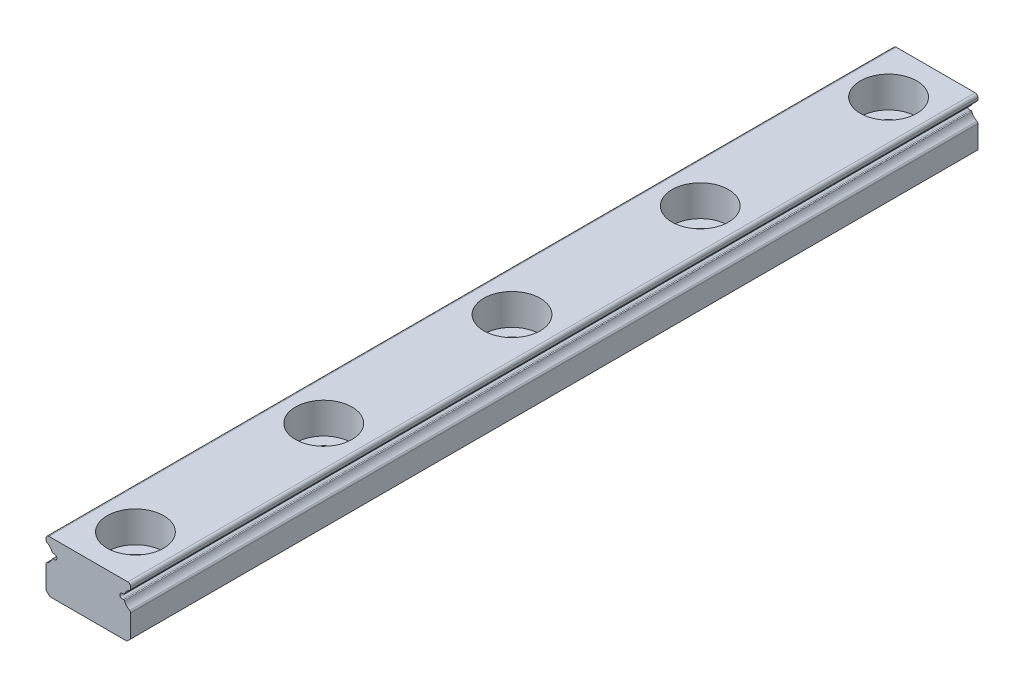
ISO-10303-21;
HEADER;
FILE_DESCRIPTION(('STEP AP214'),'2;1');
FILE_NAME('part.step','',(''),(''),'','','');
FILE_SCHEMA(('AUTOMOTIVE_DESIGN { 1 0 10303 214 1 1 1 1 }'));
ENDSEC;
DATA;
#1=APPLICATION_CONTEXT('core data for automotive mechanical design processes');
#2=APPLICATION_PROTOCOL_DEFINITION('international standard','automotive_design',2000,#1);
#3=PRODUCT_CONTEXT('',#1,'mechanical');
#4=PRODUCT('Part','Part','',(#3));
#5=PRODUCT_RELATED_PRODUCT_CATEGORY('part','',(#4));
#6=PRODUCT_DEFINITION_FORMATION('','',#4);
#7=PRODUCT_DEFINITION_CONTEXT('part definition',#1,'design');
#8=PRODUCT_DEFINITION('design','',#6,#7);
#9=PRODUCT_DEFINITION_SHAPE('','',#8);
#10=(LENGTH_UNIT() NAMED_UNIT(*) SI_UNIT(.MILLI.,.METRE.));
#11=(NAMED_UNIT(*) PLANE_ANGLE_UNIT() SI_UNIT($,.RADIAN.));
#12=(NAMED_UNIT(*) SI_UNIT($,.STERADIAN.) SOLID_ANGLE_UNIT());
#13=UNCERTAINTY_MEASURE_WITH_UNIT(LENGTH_MEASURE(1.E-05),#10,'distance_accuracy_value','');
#14=(GEOMETRIC_REPRESENTATION_CONTEXT(3) GLOBAL_UNCERTAINTY_ASSIGNED_CONTEXT((#13)) GLOBAL_UNIT_ASSIGNED_CONTEXT((#10,
#11,#12)) REPRESENTATION_CONTEXT('',''));
#15=CARTESIAN_POINT('',(0.,0.,0.));
#16=DIRECTION('',(0.,0.,1.));
#17=DIRECTION('',(1.,0.,0.));
#18=AXIS2_PLACEMENT_3D('',#15,#16,#17);
#19=CARTESIAN_POINT('',(-3.74687682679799,-5.85,-90.));
#20=DIRECTION('',(0.,-1.,0.));
#21=DIRECTION('',(0.,0.,-1.));
#22=AXIS2_PLACEMENT_3D('',#19,#20,#21);
#23=PLANE('',#22);
#24=DIRECTION('',(1.,0.,0.));
#25=VECTOR('',#24,1.);
#26=CARTESIAN_POINT('',(-3.74687682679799,-5.85,-90.));
#27=LINE('',#26,#25);
#28=CARTESIAN_POINT('',(-3.7468768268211,-5.85,-90.));
#29=VERTEX_POINT('',#28);
#30=CARTESIAN_POINT('',(-3.6,-5.85,-90.));
#31=VERTEX_POINT('',#30);
#32=EDGE_CURVE('E235',#29,#31,#27,.T.);
#33=ORIENTED_EDGE('',*,*,#32,.T.);
#34=DIRECTION('',(0.,0.,-1.));
#35=VECTOR('',#34,1.);
#36=CARTESIAN_POINT('',(-3.6,-5.85,-90.));
#37=LINE('',#36,#35);
#38=CARTESIAN_POINT('',(-3.6,-5.85,0.));
#39=VERTEX_POINT('',#38);
#40=EDGE_CURVE('E206',#31,#39,#37,.F.);
#41=ORIENTED_EDGE('',*,*,#40,.T.);
#42=DIRECTION('',(1.,0.,0.));
#43=VECTOR('',#42,1.);
#44=CARTESIAN_POINT('',(-3.74687682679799,-5.85,0.));
#45=LINE('',#44,#43);
#46=CARTESIAN_POINT('',(-3.7468768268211,-5.85,0.));
#47=VERTEX_POINT('',#46);
#48=EDGE_CURVE('E241',#39,#47,#45,.F.);
#49=ORIENTED_EDGE('',*,*,#48,.T.);
#50=DIRECTION('',(0.,0.,-1.));
#51=VECTOR('',#50,1.);
#52=CARTESIAN_POINT('',(-3.7468768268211,-5.85,-90.));
#53=LINE('',#52,#51);
#54=EDGE_CURVE('E232',#29,#47,#53,.F.);
#55=ORIENTED_EDGE('',*,*,#54,.F.);
#56=EDGE_LOOP('',(#33,#41,#49,#55));
#57=FACE_BOUND('',#56,.T.);
#58=ADVANCED_FACE('F16',(#57),#23,.T.);
#59=CARTESIAN_POINT('',(3.6,-5.85,-90.));
#60=DIRECTION('',(0.,-1.,0.));
#61=DIRECTION('',(0.,0.,-1.));
#62=AXIS2_PLACEMENT_3D('',#59,#60,#61);
#63=PLANE('',#62);
#64=DIRECTION('',(1.,0.,0.));
#65=VECTOR('',#64,1.);
#66=CARTESIAN_POINT('',(3.6,-5.85,-90.));
#67=LINE('',#66,#65);
#68=CARTESIAN_POINT('',(3.6,-5.85,-90.));
#69=VERTEX_POINT('',#68);
#70=CARTESIAN_POINT('',(3.74687682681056,-5.85,-90.));
#71=VERTEX_POINT('',#70);
#72=EDGE_CURVE('E208',#69,#71,#67,.T.);
#73=ORIENTED_EDGE('',*,*,#72,.T.);
#74=DIRECTION('',(0.,0.,-1.));
#75=VECTOR('',#74,1.);
#76=CARTESIAN_POINT('',(3.746876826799,-5.85,-90.));
#77=LINE('',#76,#75);
#78=CARTESIAN_POINT('',(3.74687682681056,-5.85,0.));
#79=VERTEX_POINT('',#78);
#80=EDGE_CURVE('E244',#79,#71,#77,.T.);
#81=ORIENTED_EDGE('',*,*,#80,.F.);
#82=DIRECTION('',(1.,0.,0.));
#83=VECTOR('',#82,1.);
#84=CARTESIAN_POINT('',(3.6,-5.85,0.));
#85=LINE('',#84,#83);
#86=CARTESIAN_POINT('',(3.6,-5.85,0.));
#87=VERTEX_POINT('',#86);
#88=EDGE_CURVE('E233',#79,#87,#85,.F.);
#89=ORIENTED_EDGE('',*,*,#88,.T.);
#90=DIRECTION('',(0.,0.,-1.));
#91=VECTOR('',#90,1.);
#92=CARTESIAN_POINT('',(3.6,-5.85,-90.));
#93=LINE('',#92,#91);
#94=EDGE_CURVE('E228',#87,#69,#93,.T.);
#95=ORIENTED_EDGE('',*,*,#94,.T.);
#96=EDGE_LOOP('',(#73,#81,#89,#95));
#97=FACE_BOUND('',#96,.T.);
#98=ADVANCED_FACE('F554',(#97),#63,.T.);
#99=CARTESIAN_POINT('',(-3.6,-6.1,-90.));
#100=DIRECTION('',(0.,0.,-1.));
#101=DIRECTION('',(-1.,0.,0.));
#102=AXIS2_PLACEMENT_3D('',#99,#100,#101);
#103=CYLINDRICAL_SURFACE('',#102,0.25);
#104=ORIENTED_EDGE('',*,*,#40,.F.);
#105=CARTESIAN_POINT('',(-3.6,-6.1,-90.));
#106=DIRECTION('',(0.,0.,-1.));
#107=DIRECTION('',(-1.,0.,0.));
#108=AXIS2_PLACEMENT_3D('',#105,#106,#107);
#109=CIRCLE('',#108,0.25);
#110=CARTESIAN_POINT('',(-3.6,-6.35,-90.));
#111=VERTEX_POINT('',#110);
#112=EDGE_CURVE('E19',#111,#31,#109,.F.);
#113=ORIENTED_EDGE('',*,*,#112,.F.);
#114=DIRECTION('',(0.,0.,1.));
#115=VECTOR('',#114,1.);
#116=CARTESIAN_POINT('',(-3.6,-6.35,-90.));
#117=LINE('',#116,#115);
#118=CARTESIAN_POINT('',(-3.6,-6.35,0.));
#119=VERTEX_POINT('',#118);
#120=EDGE_CURVE('E203',#119,#111,#117,.F.);
#121=ORIENTED_EDGE('',*,*,#120,.F.);
#122=CARTESIAN_POINT('',(-3.6,-6.1,0.));
#123=DIRECTION('',(0.,0.,-1.));
#124=DIRECTION('',(-1.,0.,0.));
#125=AXIS2_PLACEMENT_3D('',#122,#123,#124);
#126=CIRCLE('',#125,0.25);
#127=EDGE_CURVE('E249',#39,#119,#126,.T.);
#128=ORIENTED_EDGE('',*,*,#127,.F.);
#129=EDGE_LOOP('',(#104,#113,#121,#128));
#130=FACE_BOUND('',#129,.T.);
#131=ADVANCED_FACE('F200',(#130),#103,.F.);
#132=CARTESIAN_POINT('',(3.74687682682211,-5.75,-90.));
#133=DIRECTION('',(0.,0.,-1.));
#134=DIRECTION('',(-1.,0.,0.));
#135=AXIS2_PLACEMENT_3D('',#132,#133,#134);
#136=CYLINDRICAL_SURFACE('',#135,0.0999999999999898);
#137=CARTESIAN_POINT('',(3.74687682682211,-5.75,-90.));
#138=DIRECTION('',(0.,0.,-1.));
#139=DIRECTION('',(-1.,0.,0.));
#140=AXIS2_PLACEMENT_3D('',#137,#138,#139);
#141=CIRCLE('',#140,0.0999999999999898);
#142=CARTESIAN_POINT('',(3.84052964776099,-5.78505922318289,-90.));
#143=VERTEX_POINT('',#142);
#144=EDGE_CURVE('E247',#71,#143,#141,.F.);
#145=ORIENTED_EDGE('',*,*,#144,.T.);
#146=DIRECTION('',(0.,0.,-1.));
#147=VECTOR('',#146,1.);
#148=CARTESIAN_POINT('',(3.84052964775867,-5.78505922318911,-90.));
#149=LINE('',#148,#147);
#150=CARTESIAN_POINT('',(3.840529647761,-5.78505922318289,0.));
#151=VERTEX_POINT('',#150);
#152=EDGE_CURVE('E226',#143,#151,#149,.F.);
#153=ORIENTED_EDGE('',*,*,#152,.T.);
#154=CARTESIAN_POINT('',(3.74687682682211,-5.75,0.));
#155=DIRECTION('',(0.,0.,-1.));
#156=DIRECTION('',(-1.,0.,0.));
#157=AXIS2_PLACEMENT_3D('',#154,#155,#156);
#158=CIRCLE('',#157,0.0999999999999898);
#159=EDGE_CURVE('E248',#151,#79,#158,.T.);
#160=ORIENTED_EDGE('',*,*,#159,.T.);
#161=ORIENTED_EDGE('',*,*,#80,.T.);
#162=EDGE_LOOP('',(#145,#153,#160,#161));
#163=FACE_BOUND('',#162,.T.);
#164=ADVANCED_FACE('F557',(#163),#136,.T.);
#165=CARTESIAN_POINT('',(-3.7468768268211,-5.75,-90.));
#166=DIRECTION('',(0.,0.,-1.));
#167=DIRECTION('',(-1.,0.,0.));
#168=AXIS2_PLACEMENT_3D('',#165,#166,#167);
#169=CYLINDRICAL_SURFACE('',#168,0.0999999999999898);
#170=CARTESIAN_POINT('',(-3.7468768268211,-5.75,-90.));
#171=DIRECTION('',(0.,0.,-1.));
#172=DIRECTION('',(-1.,0.,0.));
#173=AXIS2_PLACEMENT_3D('',#170,#171,#172);
#174=CIRCLE('',#173,0.0999999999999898);
#175=CARTESIAN_POINT('',(-3.84052964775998,-5.78505922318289,-90.));
#176=VERTEX_POINT('',#175);
#177=EDGE_CURVE('E239',#176,#29,#174,.F.);
#178=ORIENTED_EDGE('',*,*,#177,.T.);
#179=ORIENTED_EDGE('',*,*,#54,.T.);
#180=CARTESIAN_POINT('',(-3.7468768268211,-5.75,0.));
#181=DIRECTION('',(0.,0.,-1.));
#182=DIRECTION('',(-1.,0.,0.));
#183=AXIS2_PLACEMENT_3D('',#180,#181,#182);
#184=CIRCLE('',#183,0.0999999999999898);
#185=CARTESIAN_POINT('',(-3.84052964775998,-5.78505922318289,0.));
#186=VERTEX_POINT('',#185);
#187=EDGE_CURVE('E391',#47,#186,#184,.T.);
#188=ORIENTED_EDGE('',*,*,#187,.T.);
#189=DIRECTION('',(0.,0.,-1.));
#190=VECTOR('',#189,1.);
#191=CARTESIAN_POINT('',(-3.84052964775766,-5.78505922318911,-90.));
#192=LINE('',#191,#190);
#193=EDGE_CURVE('E382',#186,#176,#192,.T.);
#194=ORIENTED_EDGE('',*,*,#193,.T.);
#195=EDGE_LOOP('',(#178,#179,#188,#194));
#196=FACE_BOUND('',#195,.T.);
#197=ADVANCED_FACE('F405',(#196),#169,.T.);
#198=CARTESIAN_POINT('',(3.6,-6.1,-90.));
#199=DIRECTION('',(0.,0.,-1.));
#200=DIRECTION('',(-1.,0.,0.));
#201=AXIS2_PLACEMENT_3D('',#198,#199,#200);
#202=CYLINDRICAL_SURFACE('',#201,0.25);
#203=DIRECTION('',(0.,0.,1.));
#204=VECTOR('',#203,1.);
#205=CARTESIAN_POINT('',(3.6,-6.35,-90.));
#206=LINE('',#205,#204);
#207=CARTESIAN_POINT('',(3.6,-6.35,-90.));
#208=VERTEX_POINT('',#207);
#209=CARTESIAN_POINT('',(3.6,-6.35,0.));
#210=VERTEX_POINT('',#209);
#211=EDGE_CURVE('E375',#208,#210,#206,.T.);
#212=ORIENTED_EDGE('',*,*,#211,.F.);
#213=CARTESIAN_POINT('',(3.6,-6.1,-90.));
#214=DIRECTION('',(0.,0.,-1.));
#215=DIRECTION('',(-1.,0.,0.));
#216=AXIS2_PLACEMENT_3D('',#213,#214,#215);
#217=CIRCLE('',#216,0.25);
#218=EDGE_CURVE('E231',#69,#208,#217,.F.);
#219=ORIENTED_EDGE('',*,*,#218,.F.);
#220=ORIENTED_EDGE('',*,*,#94,.F.);
#221=CARTESIAN_POINT('',(3.6,-6.1,0.));
#222=DIRECTION('',(0.,0.,-1.));
#223=DIRECTION('',(-1.,0.,0.));
#224=AXIS2_PLACEMENT_3D('',#221,#222,#223);
#225=CIRCLE('',#224,0.25);
#226=EDGE_CURVE('E222',#210,#87,#225,.T.);
#227=ORIENTED_EDGE('',*,*,#226,.F.);
#228=EDGE_LOOP('',(#212,#219,#220,#227));
#229=FACE_BOUND('',#228,.T.);
#230=ADVANCED_FACE('F543',(#229),#202,.F.);
#231=CARTESIAN_POINT('',(-3.6,-6.35,-90.));
#232=DIRECTION('',(0.,1.,0.));
#233=DIRECTION('',(0.,0.,1.));
#234=AXIS2_PLACEMENT_3D('',#231,#232,#233);
#235=PLANE('',#234);
#236=DIRECTION('',(1.,0.,0.));
#237=VECTOR('',#236,1.);
#238=CARTESIAN_POINT('',(-3.6,-6.35,-90.));
#239=LINE('',#238,#237);
#240=CARTESIAN_POINT('',(-3.74687682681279,-6.35,-90.));
#241=VERTEX_POINT('',#240);
#242=EDGE_CURVE('E210',#111,#241,#239,.F.);
#243=ORIENTED_EDGE('',*,*,#242,.T.);
#244=DIRECTION('',(0.,0.,-1.));
#245=VECTOR('',#244,1.);
#246=CARTESIAN_POINT('',(-3.74687682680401,-6.35,-90.));
#247=LINE('',#246,#245);
#248=CARTESIAN_POINT('',(-3.74687682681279,-6.35,0.));
#249=VERTEX_POINT('',#248);
#250=EDGE_CURVE('E371',#249,#241,#247,.T.);
#251=ORIENTED_EDGE('',*,*,#250,.F.);
#252=DIRECTION('',(1.,0.,0.));
#253=VECTOR('',#252,1.);
#254=CARTESIAN_POINT('',(-3.6,-6.35,0.));
#255=LINE('',#254,#253);
#256=EDGE_CURVE('E220',#249,#119,#255,.T.);
#257=ORIENTED_EDGE('',*,*,#256,.T.);
#258=ORIENTED_EDGE('',*,*,#120,.T.);
#259=EDGE_LOOP('',(#243,#251,#257,#258));
#260=FACE_BOUND('',#259,.T.);
#261=ADVANCED_FACE('F219',(#260),#235,.T.);
#262=CARTESIAN_POINT('',(4.87071067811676,-6.17071067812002,-90.));
#263=DIRECTION('',(0.,0.,-1.));
#264=DIRECTION('',(-1.,0.,0.));
#265=AXIS2_PLACEMENT_3D('',#262,#263,#264);
#266=CYLINDRICAL_SURFACE('',#265,1.1);
#267=ORIENTED_EDGE('',*,*,#152,.F.);
#268=CARTESIAN_POINT('',(4.87071067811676,-6.17071067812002,-90.));
#269=DIRECTION('',(0.,0.,-1.));
#270=DIRECTION('',(-1.,0.,0.));
#271=AXIS2_PLACEMENT_3D('',#268,#269,#270);
#272=CIRCLE('',#271,1.1);
#273=CARTESIAN_POINT('',(4.37722471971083,-5.18761779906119,-90.));
#274=VERTEX_POINT('',#273);
#275=EDGE_CURVE('E217',#274,#143,#272,.F.);
#276=ORIENTED_EDGE('',*,*,#275,.F.);
#277=DIRECTION('',(0.,0.,-1.));
#278=VECTOR('',#277,1.);
#279=CARTESIAN_POINT('',(4.37722471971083,-5.18761779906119,-90.));
#280=LINE('',#279,#278);
#281=CARTESIAN_POINT('',(4.37722471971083,-5.18761779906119,0.));
#282=VERTEX_POINT('',#281);
#283=EDGE_CURVE('E366',#282,#274,#280,.T.);
#284=ORIENTED_EDGE('',*,*,#283,.F.);
#285=CARTESIAN_POINT('',(4.87071067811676,-6.17071067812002,0.));
#286=DIRECTION('',(0.,0.,-1.));
#287=DIRECTION('',(-1.,0.,0.));
#288=AXIS2_PLACEMENT_3D('',#285,#286,#287);
#289=CIRCLE('',#288,1.1);
#290=EDGE_CURVE('E383',#151,#282,#289,.T.);
#291=ORIENTED_EDGE('',*,*,#290,.F.);
#292=EDGE_LOOP('',(#267,#276,#284,#291));
#293=FACE_BOUND('',#292,.T.);
#294=ADVANCED_FACE('F563',(#293),#266,.F.);
#295=CARTESIAN_POINT('',(-4.8707106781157,-6.1707106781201,-90.));
#296=DIRECTION('',(0.,0.,-1.));
#297=DIRECTION('',(-1.,0.,0.));
#298=AXIS2_PLACEMENT_3D('',#295,#296,#297);
#299=CYLINDRICAL_SURFACE('',#298,1.09999999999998);
#300=DIRECTION('',(0.,0.,-1.));
#301=VECTOR('',#300,1.);
#302=CARTESIAN_POINT('',(-4.37722471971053,-5.18761779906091,-90.));
#303=LINE('',#302,#301);
#304=CARTESIAN_POINT('',(-4.37722471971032,-5.18761779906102,-90.));
#305=VERTEX_POINT('',#304);
#306=CARTESIAN_POINT('',(-4.37722471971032,-5.18761779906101,0.));
#307=VERTEX_POINT('',#306);
#308=EDGE_CURVE('E357',#305,#307,#303,.F.);
#309=ORIENTED_EDGE('',*,*,#308,.F.);
#310=CARTESIAN_POINT('',(-4.8707106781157,-6.1707106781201,-90.));
#311=DIRECTION('',(0.,0.,-1.));
#312=DIRECTION('',(-1.,0.,0.));
#313=AXIS2_PLACEMENT_3D('',#310,#311,#312);
#314=CIRCLE('',#313,1.09999999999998);
#315=EDGE_CURVE('E380',#176,#305,#314,.F.);
#316=ORIENTED_EDGE('',*,*,#315,.F.);
#317=ORIENTED_EDGE('',*,*,#193,.F.);
#318=CARTESIAN_POINT('',(-4.8707106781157,-6.1707106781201,0.));
#319=DIRECTION('',(0.,0.,-1.));
#320=DIRECTION('',(-1.,0.,0.));
#321=AXIS2_PLACEMENT_3D('',#318,#319,#320);
#322=CIRCLE('',#321,1.09999999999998);
#323=EDGE_CURVE('E376',#307,#186,#322,.T.);
#324=ORIENTED_EDGE('',*,*,#323,.F.);
#325=EDGE_LOOP('',(#309,#316,#317,#324));
#326=FACE_BOUND('',#325,.T.);
#327=ADVANCED_FACE('F408',(#326),#299,.F.);
#328=CARTESIAN_POINT('',(3.746876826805,-6.35,-90.));
#329=DIRECTION('',(0.,1.,0.));
#330=DIRECTION('',(0.,0.,1.));
#331=AXIS2_PLACEMENT_3D('',#328,#329,#330);
#332=PLANE('',#331);
#333=DIRECTION('',(1.,0.,0.));
#334=VECTOR('',#333,1.);
#335=CARTESIAN_POINT('',(3.746876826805,-6.35,-90.));
#336=LINE('',#335,#334);
#337=CARTESIAN_POINT('',(3.74687682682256,-6.35,-90.));
#338=VERTEX_POINT('',#337);
#339=EDGE_CURVE('E527',#338,#208,#336,.F.);
#340=ORIENTED_EDGE('',*,*,#339,.T.);
#341=ORIENTED_EDGE('',*,*,#211,.T.);
#342=DIRECTION('',(1.,0.,0.));
#343=VECTOR('',#342,1.);
#344=CARTESIAN_POINT('',(3.746876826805,-6.35,0.));
#345=LINE('',#344,#343);
#346=CARTESIAN_POINT('',(3.74687682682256,-6.35,0.));
#347=VERTEX_POINT('',#346);
#348=EDGE_CURVE('E379',#210,#347,#345,.T.);
#349=ORIENTED_EDGE('',*,*,#348,.T.);
#350=DIRECTION('',(0.,0.,-1.));
#351=VECTOR('',#350,1.);
#352=CARTESIAN_POINT('',(3.74687682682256,-6.35,-90.));
#353=LINE('',#352,#351);
#354=EDGE_CURVE('E351',#338,#347,#353,.F.);
#355=ORIENTED_EDGE('',*,*,#354,.F.);
#356=EDGE_LOOP('',(#340,#341,#349,#355));
#357=FACE_BOUND('',#356,.T.);
#358=ADVANCED_FACE('F538',(#357),#332,.T.);
#359=CARTESIAN_POINT('',(-3.74687682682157,-6.45,-90.));
#360=DIRECTION('',(0.,0.,-1.));
#361=DIRECTION('',(-1.,0.,0.));
#362=AXIS2_PLACEMENT_3D('',#359,#360,#361);
#363=CYLINDRICAL_SURFACE('',#362,0.0999999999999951);
#364=CARTESIAN_POINT('',(-3.74687682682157,-6.45,-90.));
#365=DIRECTION('',(0.,0.,-1.));
#366=DIRECTION('',(-1.,0.,0.));
#367=AXIS2_PLACEMENT_3D('',#364,#365,#366);
#368=CIRCLE('',#367,0.0999999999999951);
#369=CARTESIAN_POINT('',(-3.84052964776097,-6.41494077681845,-90.));
#370=VERTEX_POINT('',#369);
#371=EDGE_CURVE('E213',#241,#370,#368,.F.);
#372=ORIENTED_EDGE('',*,*,#371,.T.);
#373=DIRECTION('',(0.,0.,-1.));
#374=VECTOR('',#373,1.);
#375=CARTESIAN_POINT('',(-3.84052964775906,-6.41494077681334,-90.));
#376=LINE('',#375,#374);
#377=CARTESIAN_POINT('',(-3.84052964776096,-6.41494077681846,0.));
#378=VERTEX_POINT('',#377);
#379=EDGE_CURVE('E348',#370,#378,#376,.F.);
#380=ORIENTED_EDGE('',*,*,#379,.T.);
#381=CARTESIAN_POINT('',(-3.74687682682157,-6.45,0.));
#382=DIRECTION('',(0.,0.,-1.));
#383=DIRECTION('',(-1.,0.,0.));
#384=AXIS2_PLACEMENT_3D('',#381,#382,#383);
#385=CIRCLE('',#384,0.0999999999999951);
#386=EDGE_CURVE('E372',#378,#249,#385,.T.);
#387=ORIENTED_EDGE('',*,*,#386,.T.);
#388=ORIENTED_EDGE('',*,*,#250,.T.);
#389=EDGE_LOOP('',(#372,#380,#387,#388));
#390=FACE_BOUND('',#389,.T.);
#391=ADVANCED_FACE('F696',(#390),#363,.T.);
#392=CARTESIAN_POINT('',(4.28763886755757,-5.00880399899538,-90.));
#393=DIRECTION('',(0.,0.,-1.));
#394=DIRECTION('',(-1.,0.,0.));
#395=AXIS2_PLACEMENT_3D('',#392,#393,#394);
#396=CYLINDRICAL_SURFACE('',#395,0.2);
#397=CARTESIAN_POINT('',(4.28763886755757,-5.00880399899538,-90.));
#398=DIRECTION('',(0.,0.,-1.));
#399=DIRECTION('',(-1.,0.,0.));
#400=AXIS2_PLACEMENT_3D('',#397,#398,#399);
#401=CIRCLE('',#400,0.2);
#402=CARTESIAN_POINT('',(4.48736019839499,-4.99824985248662,-90.));
#403=VERTEX_POINT('',#402);
#404=EDGE_CURVE('E364',#274,#403,#401,.F.);
#405=ORIENTED_EDGE('',*,*,#404,.T.);
#406=DIRECTION('',(0.,0.,1.));
#407=VECTOR('',#406,1.);
#408=CARTESIAN_POINT('',(4.48736019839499,-4.99824985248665,-90.));
#409=LINE('',#408,#407);
#410=CARTESIAN_POINT('',(4.48736019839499,-4.99824985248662,0.));
#411=VERTEX_POINT('',#410);
#412=EDGE_CURVE('E513',#411,#403,#409,.F.);
#413=ORIENTED_EDGE('',*,*,#412,.F.);
#414=CARTESIAN_POINT('',(4.28763886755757,-5.00880399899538,0.));
#415=DIRECTION('',(0.,0.,-1.));
#416=DIRECTION('',(-1.,0.,0.));
#417=AXIS2_PLACEMENT_3D('',#414,#415,#416);
#418=CIRCLE('',#417,0.2);
#419=EDGE_CURVE('E367',#411,#282,#418,.T.);
#420=ORIENTED_EDGE('',*,*,#419,.T.);
#421=ORIENTED_EDGE('',*,*,#283,.T.);
#422=EDGE_LOOP('',(#405,#413,#420,#421));
#423=FACE_BOUND('',#422,.T.);
#424=ADVANCED_FACE('F566',(#423),#396,.T.);
#425=CARTESIAN_POINT('',(-4.2875,-5.00887363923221,-90.));
#426=DIRECTION('',(0.,0.,-1.));
#427=DIRECTION('',(-1.,0.,0.));
#428=AXIS2_PLACEMENT_3D('',#425,#426,#427);
#429=CYLINDRICAL_SURFACE('',#428,0.2);
#430=CARTESIAN_POINT('',(-4.2875,-5.00887363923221,-90.));
#431=DIRECTION('',(0.,0.,-1.));
#432=DIRECTION('',(-1.,0.,0.));
#433=AXIS2_PLACEMENT_3D('',#430,#431,#432);
#434=CIRCLE('',#433,0.2);
#435=CARTESIAN_POINT('',(-4.4875,-5.00887363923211,-90.));
#436=VERTEX_POINT('',#435);
#437=EDGE_CURVE('E358',#436,#305,#434,.F.);
#438=ORIENTED_EDGE('',*,*,#437,.T.);
#439=ORIENTED_EDGE('',*,*,#308,.T.);
#440=CARTESIAN_POINT('',(-4.2875,-5.00887363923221,0.));
#441=DIRECTION('',(0.,0.,-1.));
#442=DIRECTION('',(-1.,0.,0.));
#443=AXIS2_PLACEMENT_3D('',#440,#441,#442);
#444=CIRCLE('',#443,0.2);
#445=CARTESIAN_POINT('',(-4.4875,-5.00887363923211,0.));
#446=VERTEX_POINT('',#445);
#447=EDGE_CURVE('E361',#307,#446,#444,.T.);
#448=ORIENTED_EDGE('',*,*,#447,.T.);
#449=DIRECTION('',(0.,0.,1.));
#450=VECTOR('',#449,1.);
#451=CARTESIAN_POINT('',(-4.4875,-5.00887363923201,-90.));
#452=LINE('',#451,#450);
#453=EDGE_CURVE('E415',#436,#446,#452,.T.);
#454=ORIENTED_EDGE('',*,*,#453,.F.);
#455=EDGE_LOOP('',(#438,#439,#448,#454));
#456=FACE_BOUND('',#455,.T.);
#457=ADVANCED_FACE('F413',(#456),#429,.T.);
#458=CARTESIAN_POINT('',(3.74687682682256,-6.45,-90.));
#459=DIRECTION('',(0.,0.,-1.));
#460=DIRECTION('',(-1.,0.,0.));
#461=AXIS2_PLACEMENT_3D('',#458,#459,#460);
#462=CYLINDRICAL_SURFACE('',#461,0.100000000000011);
#463=CARTESIAN_POINT('',(3.74687682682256,-6.45,-90.));
#464=DIRECTION('',(0.,0.,-1.));
#465=DIRECTION('',(-1.,0.,0.));
#466=AXIS2_PLACEMENT_3D('',#463,#464,#465);
#467=CIRCLE('',#466,0.100000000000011);
#468=CARTESIAN_POINT('',(3.84052964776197,-6.41494077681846,-90.));
#469=VERTEX_POINT('',#468);
#470=EDGE_CURVE('E352',#469,#338,#467,.F.);
#471=ORIENTED_EDGE('',*,*,#470,.T.);
#472=ORIENTED_EDGE('',*,*,#354,.T.);
#473=CARTESIAN_POINT('',(3.74687682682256,-6.45,0.));
#474=DIRECTION('',(0.,0.,-1.));
#475=DIRECTION('',(-1.,0.,0.));
#476=AXIS2_PLACEMENT_3D('',#473,#474,#475);
#477=CIRCLE('',#476,0.100000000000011);
#478=CARTESIAN_POINT('',(3.84052964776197,-6.41494077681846,0.));
#479=VERTEX_POINT('',#478);
#480=EDGE_CURVE('E355',#347,#479,#477,.T.);
#481=ORIENTED_EDGE('',*,*,#480,.T.);
#482=DIRECTION('',(0.,0.,-1.));
#483=VECTOR('',#482,1.);
#484=CARTESIAN_POINT('',(3.84052964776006,-6.41494077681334,-90.));
#485=LINE('',#484,#483);
#486=EDGE_CURVE('E344',#479,#469,#485,.T.);
#487=ORIENTED_EDGE('',*,*,#486,.T.);
#488=EDGE_LOOP('',(#471,#472,#481,#487));
#489=FACE_BOUND('',#488,.T.);
#490=ADVANCED_FACE('F549',(#489),#462,.T.);
#491=CARTESIAN_POINT('',(-4.87071067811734,-6.02928932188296,-90.));
#492=DIRECTION('',(0.,0.,-1.));
#493=DIRECTION('',(-1.,0.,0.));
#494=AXIS2_PLACEMENT_3D('',#491,#492,#493);
#495=CYLINDRICAL_SURFACE('',#494,1.1);
#496=ORIENTED_EDGE('',*,*,#379,.F.);
#497=CARTESIAN_POINT('',(-4.87071067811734,-6.02928932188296,-90.));
#498=DIRECTION('',(0.,0.,-1.));
#499=DIRECTION('',(-1.,0.,0.));
#500=AXIS2_PLACEMENT_3D('',#497,#498,#499);
#501=CIRCLE('',#500,1.1);
#502=CARTESIAN_POINT('',(-4.38780164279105,-7.0176206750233,-90.));
#503=VERTEX_POINT('',#502);
#504=EDGE_CURVE('E349',#503,#370,#501,.F.);
#505=ORIENTED_EDGE('',*,*,#504,.F.);
#506=DIRECTION('',(0.,0.,-1.));
#507=VECTOR('',#506,1.);
#508=CARTESIAN_POINT('',(-4.38780164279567,-7.01762067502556,-90.));
#509=LINE('',#508,#507);
#510=CARTESIAN_POINT('',(-4.38780164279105,-7.0176206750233,0.));
#511=VERTEX_POINT('',#510);
#512=EDGE_CURVE('E335',#511,#503,#509,.T.);
#513=ORIENTED_EDGE('',*,*,#512,.F.);
#514=CARTESIAN_POINT('',(-4.87071067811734,-6.02928932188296,0.));
#515=DIRECTION('',(0.,0.,-1.));
#516=DIRECTION('',(-1.,0.,0.));
#517=AXIS2_PLACEMENT_3D('',#514,#515,#516);
#518=CIRCLE('',#517,1.1);
#519=EDGE_CURVE('E345',#378,#511,#518,.T.);
#520=ORIENTED_EDGE('',*,*,#519,.F.);
#521=EDGE_LOOP('',(#496,#505,#513,#520));
#522=FACE_BOUND('',#521,.T.);
#523=ADVANCED_FACE('F698',(#522),#495,.F.);
#524=CARTESIAN_POINT('',(4.48736019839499,-4.99824985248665,-90.));
#525=DIRECTION('',(0.999999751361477,-0.000705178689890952,0.));
#526=DIRECTION('',(0.000705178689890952,0.999999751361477,0.));
#527=AXIS2_PLACEMENT_3D('',#524,#525,#526);
#528=PLANE('',#527);
#529=DIRECTION('',(0.000705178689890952,0.999999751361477,0.));
#530=VECTOR('',#529,1.);
#531=CARTESIAN_POINT('',(4.48736019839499,-4.99824985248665,-90.));
#532=LINE('',#531,#530);
#533=CARTESIAN_POINT('',(4.48749985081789,-4.80021155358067,-90.));
#534=VERTEX_POINT('',#533);
#535=EDGE_CURVE('E509',#403,#534,#532,.T.);
#536=ORIENTED_EDGE('',*,*,#535,.T.);
#537=DIRECTION('',(0.,0.,-1.));
#538=VECTOR('',#537,1.);
#539=CARTESIAN_POINT('',(4.48749985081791,-4.80021155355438,-90.));
#540=LINE('',#539,#538);
#541=CARTESIAN_POINT('',(4.48749985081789,-4.80021155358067,0.));
#542=VERTEX_POINT('',#541);
#543=EDGE_CURVE('E329',#542,#534,#540,.T.);
#544=ORIENTED_EDGE('',*,*,#543,.F.);
#545=DIRECTION('',(0.000705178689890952,0.999999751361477,0.));
#546=VECTOR('',#545,1.);
#547=CARTESIAN_POINT('',(4.48736019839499,-4.99824985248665,0.));
#548=LINE('',#547,#546);
#549=EDGE_CURVE('E347',#542,#411,#548,.F.);
#550=ORIENTED_EDGE('',*,*,#549,.T.);
#551=ORIENTED_EDGE('',*,*,#412,.T.);
#552=EDGE_LOOP('',(#536,#544,#550,#551));
#553=FACE_BOUND('',#552,.T.);
#554=ADVANCED_FACE('F570',(#553),#528,.T.);
#555=CARTESIAN_POINT('',(-4.4875,-4.8,-90.));
#556=DIRECTION('',(-1.,0.,0.));
#557=DIRECTION('',(0.,0.,1.));
#558=AXIS2_PLACEMENT_3D('',#555,#556,#557);
#559=PLANE('',#558);
#560=DIRECTION('',(0.,1.,0.));
#561=VECTOR('',#560,1.);
#562=CARTESIAN_POINT('',(-4.4875,-4.8,-90.));
#563=LINE('',#562,#561);
#564=CARTESIAN_POINT('',(-4.4875,-4.8,-90.));
#565=VERTEX_POINT('',#564);
#566=EDGE_CURVE('E417',#565,#436,#563,.F.);
#567=ORIENTED_EDGE('',*,*,#566,.T.);
#568=ORIENTED_EDGE('',*,*,#453,.T.);
#569=DIRECTION('',(0.,1.,0.));
#570=VECTOR('',#569,1.);
#571=CARTESIAN_POINT('',(-4.4875,-4.8,0.));
#572=LINE('',#571,#570);
#573=CARTESIAN_POINT('',(-4.4875,-4.8,0.));
#574=VERTEX_POINT('',#573);
#575=EDGE_CURVE('E422',#446,#574,#572,.T.);
#576=ORIENTED_EDGE('',*,*,#575,.T.);
#577=DIRECTION('',(0.,0.,-1.));
#578=VECTOR('',#577,1.);
#579=CARTESIAN_POINT('',(-4.4875,-4.8,-90.));
#580=LINE('',#579,#578);
#581=EDGE_CURVE('E321',#565,#574,#580,.F.);
#582=ORIENTED_EDGE('',*,*,#581,.F.);
#583=EDGE_LOOP('',(#567,#568,#576,#582));
#584=FACE_BOUND('',#583,.T.);
#585=ADVANCED_FACE('F426',(#584),#559,.T.);
#586=CARTESIAN_POINT('',(4.87071067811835,-6.02928932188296,-90.));
#587=DIRECTION('',(0.,0.,-1.));
#588=DIRECTION('',(-1.,0.,0.));
#589=AXIS2_PLACEMENT_3D('',#586,#587,#588);
#590=CYLINDRICAL_SURFACE('',#589,1.1);
#591=DIRECTION('',(0.,0.,-1.));
#592=VECTOR('',#591,1.);
#593=CARTESIAN_POINT('',(4.38780164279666,-7.01762067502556,-90.));
#594=LINE('',#593,#592);
#595=CARTESIAN_POINT('',(4.38780164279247,-7.01762067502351,-90.));
#596=VERTEX_POINT('',#595);
#597=CARTESIAN_POINT('',(4.38780164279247,-7.01762067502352,0.));
#598=VERTEX_POINT('',#597);
#599=EDGE_CURVE('E315',#596,#598,#594,.F.);
#600=ORIENTED_EDGE('',*,*,#599,.F.);
#601=CARTESIAN_POINT('',(4.87071067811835,-6.02928932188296,-90.));
#602=DIRECTION('',(0.,0.,-1.));
#603=DIRECTION('',(-1.,0.,0.));
#604=AXIS2_PLACEMENT_3D('',#601,#602,#603);
#605=CIRCLE('',#604,1.1);
#606=EDGE_CURVE('E342',#469,#596,#605,.F.);
#607=ORIENTED_EDGE('',*,*,#606,.F.);
#608=ORIENTED_EDGE('',*,*,#486,.F.);
#609=CARTESIAN_POINT('',(4.87071067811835,-6.02928932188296,0.));
#610=DIRECTION('',(0.,0.,-1.));
#611=DIRECTION('',(-1.,0.,0.));
#612=AXIS2_PLACEMENT_3D('',#609,#610,#611);
#613=CIRCLE('',#612,1.1);
#614=EDGE_CURVE('E339',#598,#479,#613,.T.);
#615=ORIENTED_EDGE('',*,*,#614,.F.);
#616=EDGE_LOOP('',(#600,#607,#608,#615));
#617=FACE_BOUND('',#616,.T.);
#618=ADVANCED_FACE('F700',(#617),#590,.F.);
#619=CARTESIAN_POINT('',(-4.29999999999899,-7.19731728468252,-90.));
#620=DIRECTION('',(0.,0.,-1.));
#621=DIRECTION('',(-1.,0.,0.));
#622=AXIS2_PLACEMENT_3D('',#619,#620,#621);
#623=CYLINDRICAL_SURFACE('',#622,0.200000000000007);
#624=CARTESIAN_POINT('',(-4.29999999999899,-7.19731728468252,-90.));
#625=DIRECTION('',(0.,0.,-1.));
#626=DIRECTION('',(-1.,0.,0.));
#627=AXIS2_PLACEMENT_3D('',#624,#625,#626);
#628=CIRCLE('',#627,0.200000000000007);
#629=CARTESIAN_POINT('',(-4.499999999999,-7.19731728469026,-90.));
#630=VERTEX_POINT('',#629);
#631=EDGE_CURVE('E333',#503,#630,#628,.F.);
#632=ORIENTED_EDGE('',*,*,#631,.T.);
#633=DIRECTION('',(0.,0.,1.));
#634=VECTOR('',#633,1.);
#635=CARTESIAN_POINT('',(-4.499999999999,-7.19731728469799,-90.));
#636=LINE('',#635,#634);
#637=CARTESIAN_POINT('',(-4.499999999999,-7.19731728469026,0.));
#638=VERTEX_POINT('',#637);
#639=EDGE_CURVE('E308',#638,#630,#636,.F.);
#640=ORIENTED_EDGE('',*,*,#639,.F.);
#641=CARTESIAN_POINT('',(-4.29999999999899,-7.19731728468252,0.));
#642=DIRECTION('',(0.,0.,-1.));
#643=DIRECTION('',(-1.,0.,0.));
#644=AXIS2_PLACEMENT_3D('',#641,#642,#643);
#645=CIRCLE('',#644,0.200000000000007);
#646=EDGE_CURVE('E336',#638,#511,#645,.T.);
#647=ORIENTED_EDGE('',*,*,#646,.T.);
#648=ORIENTED_EDGE('',*,*,#512,.T.);
#649=EDGE_LOOP('',(#632,#640,#647,#648));
#650=FACE_BOUND('',#649,.T.);
#651=ADVANCED_FACE('F691',(#650),#623,.T.);
#652=CARTESIAN_POINT('',(0.,-10.,-65.));
#653=DIRECTION('',(0.,1.,0.));
#654=DIRECTION('',(0.,0.,1.));
#655=AXIS2_PLACEMENT_3D('',#652,#653,#654);
#656=CYLINDRICAL_SURFACE('',#655,3.);
#657=CARTESIAN_POINT('',(0.,-4.5,-65.));
#658=DIRECTION('',(0.,1.,0.));
#659=DIRECTION('',(0.,0.,1.));
#660=AXIS2_PLACEMENT_3D('',#657,#658,#659);
#661=CIRCLE('',#660,3.);
#662=CARTESIAN_POINT('',(0.,-4.5,-62.));
#663=VERTEX_POINT('',#662);
#664=EDGE_CURVE('E305',#663,#663,#661,.F.);
#665=ORIENTED_EDGE('',*,*,#664,.F.);
#666=EDGE_LOOP('',(#665));
#667=FACE_BOUND('',#666,.T.);
#668=CARTESIAN_POINT('',(0.,-7.8,-65.));
#669=DIRECTION('',(0.,1.,0.));
#670=DIRECTION('',(0.,0.,1.));
#671=AXIS2_PLACEMENT_3D('',#668,#669,#670);
#672=CIRCLE('',#671,3.);
#673=CARTESIAN_POINT('',(0.,-7.8,-62.));
#674=VERTEX_POINT('',#673);
#675=EDGE_CURVE('E312',#674,#674,#672,.T.);
#676=ORIENTED_EDGE('',*,*,#675,.F.);
#677=EDGE_LOOP('',(#676));
#678=FACE_BOUND('',#677,.T.);
#679=ADVANCED_FACE('F584',(#667,#678),#656,.F.);
#680=CARTESIAN_POINT('',(0.,-10.,-25.));
#681=DIRECTION('',(0.,1.,0.));
#682=DIRECTION('',(0.,0.,1.));
#683=AXIS2_PLACEMENT_3D('',#680,#681,#682);
#684=CYLINDRICAL_SURFACE('',#683,3.);
#685=CARTESIAN_POINT('',(0.,-4.5,-25.));
#686=DIRECTION('',(0.,1.,0.));
#687=DIRECTION('',(0.,0.,1.));
#688=AXIS2_PLACEMENT_3D('',#685,#686,#687);
#689=CIRCLE('',#688,3.);
#690=CARTESIAN_POINT('',(0.,-4.5,-22.));
#691=VERTEX_POINT('',#690);
#692=EDGE_CURVE('E301',#691,#691,#689,.F.);
#693=ORIENTED_EDGE('',*,*,#692,.F.);
#694=EDGE_LOOP('',(#693));
#695=FACE_BOUND('',#694,.T.);
#696=CARTESIAN_POINT('',(0.,-7.8,-25.));
#697=DIRECTION('',(0.,1.,0.));
#698=DIRECTION('',(0.,0.,1.));
#699=AXIS2_PLACEMENT_3D('',#696,#697,#698);
#700=CIRCLE('',#699,3.);
#701=CARTESIAN_POINT('',(0.,-7.8,-22.));
#702=VERTEX_POINT('',#701);
#703=EDGE_CURVE('E309',#702,#702,#700,.T.);
#704=ORIENTED_EDGE('',*,*,#703,.F.);
#705=EDGE_LOOP('',(#704));
#706=FACE_BOUND('',#705,.T.);
#707=ADVANCED_FACE('F574',(#695,#706),#684,.F.);
#708=CARTESIAN_POINT('',(4.18749992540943,-4.8,-90.));
#709=DIRECTION('',(0.,0.,-1.));
#710=DIRECTION('',(-1.,0.,0.));
#711=AXIS2_PLACEMENT_3D('',#708,#709,#710);
#712=CYLINDRICAL_SURFACE('',#711,0.3);
#713=CARTESIAN_POINT('',(4.18749992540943,-4.8,-90.));
#714=DIRECTION('',(0.,0.,-1.));
#715=DIRECTION('',(-1.,0.,0.));
#716=AXIS2_PLACEMENT_3D('',#713,#714,#715);
#717=CIRCLE('',#716,0.3);
#718=CARTESIAN_POINT('',(4.18749996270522,-4.5,-90.));
#719=VERTEX_POINT('',#718);
#720=EDGE_CURVE('E327',#534,#719,#717,.F.);
#721=ORIENTED_EDGE('',*,*,#720,.T.);
#722=DIRECTION('',(0.,0.,1.));
#723=VECTOR('',#722,1.);
#724=CARTESIAN_POINT('',(4.187500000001,-4.5,-90.));
#725=LINE('',#724,#723);
#726=CARTESIAN_POINT('',(4.18749996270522,-4.5,0.));
#727=VERTEX_POINT('',#726);
#728=EDGE_CURVE('E304',#727,#719,#725,.F.);
#729=ORIENTED_EDGE('',*,*,#728,.F.);
#730=CARTESIAN_POINT('',(4.18749992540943,-4.8,0.));
#731=DIRECTION('',(0.,0.,-1.));
#732=DIRECTION('',(-1.,0.,0.));
#733=AXIS2_PLACEMENT_3D('',#730,#731,#732);
#734=CIRCLE('',#733,0.3);
#735=EDGE_CURVE('E330',#727,#542,#734,.T.);
#736=ORIENTED_EDGE('',*,*,#735,.T.);
#737=ORIENTED_EDGE('',*,*,#543,.T.);
#738=EDGE_LOOP('',(#721,#729,#736,#737));
#739=FACE_BOUND('',#738,.T.);
#740=ADVANCED_FACE('F572',(#739),#712,.T.);
#741=CARTESIAN_POINT('',(-4.1875,-4.8,-90.));
#742=DIRECTION('',(0.,0.,-1.));
#743=DIRECTION('',(-1.,0.,0.));
#744=AXIS2_PLACEMENT_3D('',#741,#742,#743);
#745=CYLINDRICAL_SURFACE('',#744,0.300000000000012);
#746=CARTESIAN_POINT('',(-4.1875,-4.8,-90.));
#747=DIRECTION('',(0.,0.,-1.));
#748=DIRECTION('',(-1.,0.,0.));
#749=AXIS2_PLACEMENT_3D('',#746,#747,#748);
#750=CIRCLE('',#749,0.300000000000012);
#751=CARTESIAN_POINT('',(-4.1874999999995,-4.5,-90.));
#752=VERTEX_POINT('',#751);
#753=EDGE_CURVE('E322',#752,#565,#750,.F.);
#754=ORIENTED_EDGE('',*,*,#753,.T.);
#755=ORIENTED_EDGE('',*,*,#581,.T.);
#756=CARTESIAN_POINT('',(-4.1875,-4.8,0.));
#757=DIRECTION('',(0.,0.,-1.));
#758=DIRECTION('',(-1.,0.,0.));
#759=AXIS2_PLACEMENT_3D('',#756,#757,#758);
#760=CIRCLE('',#759,0.300000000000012);
#761=CARTESIAN_POINT('',(-4.1874999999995,-4.5,0.));
#762=VERTEX_POINT('',#761);
#763=EDGE_CURVE('E325',#574,#762,#760,.T.);
#764=ORIENTED_EDGE('',*,*,#763,.T.);
#765=DIRECTION('',(0.,0.,1.));
#766=VECTOR('',#765,1.);
#767=CARTESIAN_POINT('',(-4.187499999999,-4.5,-90.));
#768=LINE('',#767,#766);
#769=EDGE_CURVE('E300',#752,#762,#768,.T.);
#770=ORIENTED_EDGE('',*,*,#769,.F.);
#771=EDGE_LOOP('',(#754,#755,#764,#770));
#772=FACE_BOUND('',#771,.T.);
#773=ADVANCED_FACE('F429',(#772),#745,.T.);
#774=CARTESIAN_POINT('',(4.300000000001,-7.19731728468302,-90.));
#775=DIRECTION('',(0.,0.,-1.));
#776=DIRECTION('',(-1.,0.,0.));
#777=AXIS2_PLACEMENT_3D('',#774,#775,#776);
#778=CYLINDRICAL_SURFACE('',#777,0.200000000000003);
#779=CARTESIAN_POINT('',(4.300000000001,-7.19731728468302,-90.));
#780=DIRECTION('',(0.,0.,-1.));
#781=DIRECTION('',(-1.,0.,0.));
#782=AXIS2_PLACEMENT_3D('',#779,#780,#781);
#783=CIRCLE('',#782,0.200000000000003);
#784=CARTESIAN_POINT('',(4.500000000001,-7.19731728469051,-90.));
#785=VERTEX_POINT('',#784);
#786=EDGE_CURVE('E316',#785,#596,#783,.F.);
#787=ORIENTED_EDGE('',*,*,#786,.T.);
#788=ORIENTED_EDGE('',*,*,#599,.T.);
#789=CARTESIAN_POINT('',(4.300000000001,-7.19731728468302,0.));
#790=DIRECTION('',(0.,0.,-1.));
#791=DIRECTION('',(-1.,0.,0.));
#792=AXIS2_PLACEMENT_3D('',#789,#790,#791);
#793=CIRCLE('',#792,0.200000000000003);
#794=CARTESIAN_POINT('',(4.500000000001,-7.19731728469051,0.));
#795=VERTEX_POINT('',#794);
#796=EDGE_CURVE('E319',#598,#795,#793,.T.);
#797=ORIENTED_EDGE('',*,*,#796,.T.);
#798=DIRECTION('',(0.,0.,-1.));
#799=VECTOR('',#798,1.);
#800=CARTESIAN_POINT('',(4.500000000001,-7.19731728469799,-90.));
#801=LINE('',#800,#799);
#802=EDGE_CURVE('E290',#785,#795,#801,.F.);
#803=ORIENTED_EDGE('',*,*,#802,.F.);
#804=EDGE_LOOP('',(#787,#788,#797,#803));
#805=FACE_BOUND('',#804,.T.);
#806=ADVANCED_FACE('F582',(#805),#778,.T.);
#807=CARTESIAN_POINT('',(0.,-10.,-5.));
#808=DIRECTION('',(0.,1.,0.));
#809=DIRECTION('',(0.,0.,1.));
#810=AXIS2_PLACEMENT_3D('',#807,#808,#809);
#811=CYLINDRICAL_SURFACE('',#810,3.);
#812=CARTESIAN_POINT('',(0.,-4.5,-5.));
#813=DIRECTION('',(0.,1.,0.));
#814=DIRECTION('',(0.,0.,1.));
#815=AXIS2_PLACEMENT_3D('',#812,#813,#814);
#816=CIRCLE('',#815,3.);
#817=CARTESIAN_POINT('',(0.,-4.5,-2.));
#818=VERTEX_POINT('',#817);
#819=EDGE_CURVE('E297',#818,#818,#816,.F.);
#820=ORIENTED_EDGE('',*,*,#819,.F.);
#821=EDGE_LOOP('',(#820));
#822=FACE_BOUND('',#821,.T.);
#823=CARTESIAN_POINT('',(0.,-7.8,-5.));
#824=DIRECTION('',(0.,1.,0.));
#825=DIRECTION('',(0.,0.,1.));
#826=AXIS2_PLACEMENT_3D('',#823,#824,#825);
#827=CIRCLE('',#826,3.);
#828=CARTESIAN_POINT('',(0.,-7.8,-2.));
#829=VERTEX_POINT('',#828);
#830=EDGE_CURVE('E287',#829,#829,#827,.T.);
#831=ORIENTED_EDGE('',*,*,#830,.F.);
#832=EDGE_LOOP('',(#831));
#833=FACE_BOUND('',#832,.T.);
#834=ADVANCED_FACE('F666',(#822,#833),#811,.F.);
#835=CARTESIAN_POINT('',(0.,-10.,-45.));
#836=DIRECTION('',(0.,1.,0.));
#837=DIRECTION('',(0.,0.,1.));
#838=AXIS2_PLACEMENT_3D('',#835,#836,#837);
#839=CYLINDRICAL_SURFACE('',#838,3.);
#840=CARTESIAN_POINT('',(0.,-4.5,-45.));
#841=DIRECTION('',(0.,1.,0.));
#842=DIRECTION('',(0.,0.,1.));
#843=AXIS2_PLACEMENT_3D('',#840,#841,#842);
#844=CIRCLE('',#843,3.);
#845=CARTESIAN_POINT('',(0.,-4.5,-42.));
#846=VERTEX_POINT('',#845);
#847=EDGE_CURVE('E294',#846,#846,#844,.F.);
#848=ORIENTED_EDGE('',*,*,#847,.F.);
#849=EDGE_LOOP('',(#848));
#850=FACE_BOUND('',#849,.T.);
#851=CARTESIAN_POINT('',(0.,-7.8,-45.));
#852=DIRECTION('',(0.,1.,0.));
#853=DIRECTION('',(0.,0.,1.));
#854=AXIS2_PLACEMENT_3D('',#851,#852,#853);
#855=CIRCLE('',#854,3.);
#856=CARTESIAN_POINT('',(0.,-7.8,-42.));
#857=VERTEX_POINT('',#856);
#858=EDGE_CURVE('E284',#857,#857,#855,.T.);
#859=ORIENTED_EDGE('',*,*,#858,.F.);
#860=EDGE_LOOP('',(#859));
#861=FACE_BOUND('',#860,.T.);
#862=ADVANCED_FACE('F662',(#850,#861),#839,.F.);
#863=CARTESIAN_POINT('',(0.,-10.,-85.));
#864=DIRECTION('',(0.,1.,0.));
#865=DIRECTION('',(0.,0.,1.));
#866=AXIS2_PLACEMENT_3D('',#863,#864,#865);
#867=CYLINDRICAL_SURFACE('',#866,3.);
#868=CARTESIAN_POINT('',(0.,-4.5,-85.));
#869=DIRECTION('',(0.,1.,0.));
#870=DIRECTION('',(0.,0.,1.));
#871=AXIS2_PLACEMENT_3D('',#868,#869,#870);
#872=CIRCLE('',#871,3.);
#873=CARTESIAN_POINT('',(0.,-4.5,-82.));
#874=VERTEX_POINT('',#873);
#875=EDGE_CURVE('E291',#874,#874,#872,.F.);
#876=ORIENTED_EDGE('',*,*,#875,.F.);
#877=EDGE_LOOP('',(#876));
#878=FACE_BOUND('',#877,.T.);
#879=CARTESIAN_POINT('',(0.,-7.8,-85.));
#880=DIRECTION('',(0.,1.,0.));
#881=DIRECTION('',(0.,0.,1.));
#882=AXIS2_PLACEMENT_3D('',#879,#880,#881);
#883=CIRCLE('',#882,3.);
#884=CARTESIAN_POINT('',(0.,-7.8,-82.));
#885=VERTEX_POINT('',#884);
#886=EDGE_CURVE('E281',#885,#885,#883,.T.);
#887=ORIENTED_EDGE('',*,*,#886,.F.);
#888=EDGE_LOOP('',(#887));
#889=FACE_BOUND('',#888,.T.);
#890=ADVANCED_FACE('F658',(#878,#889),#867,.F.);
#891=CARTESIAN_POINT('',(0.,-7.8,-68.));
#892=DIRECTION('',(0.,1.,0.));
#893=DIRECTION('',(0.,0.,1.));
#894=AXIS2_PLACEMENT_3D('',#891,#892,#893);
#895=PLANE('',#894);
#896=ORIENTED_EDGE('',*,*,#675,.T.);
#897=EDGE_LOOP('',(#896));
#898=FACE_BOUND('',#897,.T.);
#899=CARTESIAN_POINT('',(0.,-7.8,-65.));
#900=DIRECTION('',(0.,1.,0.));
#901=DIRECTION('',(0.,0.,1.));
#902=AXIS2_PLACEMENT_3D('',#899,#900,#901);
#903=CIRCLE('',#902,1.75);
#904=CARTESIAN_POINT('',(0.,-7.8,-63.25));
#905=VERTEX_POINT('',#904);
#906=EDGE_CURVE('E278',#905,#905,#903,.F.);
#907=ORIENTED_EDGE('',*,*,#906,.T.);
#908=EDGE_LOOP('',(#907));
#909=FACE_BOUND('',#908,.T.);
#910=ADVANCED_FACE('F654',(#898,#909),#895,.T.);
#911=CARTESIAN_POINT('',(0.,-7.8,-28.));
#912=DIRECTION('',(0.,1.,0.));
#913=DIRECTION('',(0.,0.,1.));
#914=AXIS2_PLACEMENT_3D('',#911,#912,#913);
#915=PLANE('',#914);
#916=ORIENTED_EDGE('',*,*,#703,.T.);
#917=EDGE_LOOP('',(#916));
#918=FACE_BOUND('',#917,.T.);
#919=CARTESIAN_POINT('',(0.,-7.8,-25.));
#920=DIRECTION('',(0.,1.,0.));
#921=DIRECTION('',(0.,0.,1.));
#922=AXIS2_PLACEMENT_3D('',#919,#920,#921);
#923=CIRCLE('',#922,1.75);
#924=CARTESIAN_POINT('',(0.,-7.8,-23.25));
#925=VERTEX_POINT('',#924);
#926=EDGE_CURVE('E274',#925,#925,#923,.F.);
#927=ORIENTED_EDGE('',*,*,#926,.T.);
#928=EDGE_LOOP('',(#927));
#929=FACE_BOUND('',#928,.T.);
#930=ADVANCED_FACE('F650',(#918,#929),#915,.T.);
#931=CARTESIAN_POINT('',(-4.499999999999,-7.19731728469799,-90.));
#932=DIRECTION('',(-1.,0.,0.));
#933=DIRECTION('',(0.,0.,1.));
#934=AXIS2_PLACEMENT_3D('',#931,#932,#933);
#935=PLANE('',#934);
#936=DIRECTION('',(0.,1.,0.));
#937=VECTOR('',#936,1.);
#938=CARTESIAN_POINT('',(-4.499999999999,-7.19731728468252,-90.));
#939=LINE('',#938,#937);
#940=CARTESIAN_POINT('',(-4.499999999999,-9.6,-90.));
#941=VERTEX_POINT('',#940);
#942=EDGE_CURVE('E456',#630,#941,#939,.F.);
#943=ORIENTED_EDGE('',*,*,#942,.T.);
#944=DIRECTION('',(0.,0.,1.));
#945=VECTOR('',#944,1.);
#946=CARTESIAN_POINT('',(-4.499999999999,-9.6,-90.));
#947=LINE('',#946,#945);
#948=CARTESIAN_POINT('',(-4.499999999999,-9.6,0.));
#949=VERTEX_POINT('',#948);
#950=EDGE_CURVE('E458',#949,#941,#947,.F.);
#951=ORIENTED_EDGE('',*,*,#950,.F.);
#952=DIRECTION('',(0.,1.,0.));
#953=VECTOR('',#952,1.);
#954=CARTESIAN_POINT('',(-4.499999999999,-7.19731728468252,0.));
#955=LINE('',#954,#953);
#956=EDGE_CURVE('E277',#638,#949,#955,.F.);
#957=ORIENTED_EDGE('',*,*,#956,.F.);
#958=ORIENTED_EDGE('',*,*,#639,.T.);
#959=EDGE_LOOP('',(#943,#951,#957,#958));
#960=FACE_BOUND('',#959,.T.);
#961=ADVANCED_FACE('F646',(#960),#935,.T.);
#962=CARTESIAN_POINT('',(4.187500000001,-4.5,-90.));
#963=DIRECTION('',(0.,1.,0.));
#964=DIRECTION('',(0.,0.,1.));
#965=AXIS2_PLACEMENT_3D('',#962,#963,#964);
#966=PLANE('',#965);
#967=ORIENTED_EDGE('',*,*,#875,.T.);
#968=EDGE_LOOP('',(#967));
#969=FACE_BOUND('',#968,.T.);
#970=ORIENTED_EDGE('',*,*,#847,.T.);
#971=EDGE_LOOP('',(#970));
#972=FACE_BOUND('',#971,.T.);
#973=ORIENTED_EDGE('',*,*,#819,.T.);
#974=EDGE_LOOP('',(#973));
#975=FACE_BOUND('',#974,.T.);
#976=DIRECTION('',(1.,0.,0.));
#977=VECTOR('',#976,1.);
#978=CARTESIAN_POINT('',(-4.29999999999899,-4.5,-90.));
#979=LINE('',#978,#977);
#980=EDGE_CURVE('E437',#719,#752,#979,.F.);
#981=ORIENTED_EDGE('',*,*,#980,.T.);
#982=ORIENTED_EDGE('',*,*,#769,.T.);
#983=DIRECTION('',(1.,0.,0.));
#984=VECTOR('',#983,1.);
#985=CARTESIAN_POINT('',(-4.29999999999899,-4.5,0.));
#986=LINE('',#985,#984);
#987=EDGE_CURVE('E461',#727,#762,#986,.F.);
#988=ORIENTED_EDGE('',*,*,#987,.F.);
#989=ORIENTED_EDGE('',*,*,#728,.T.);
#990=EDGE_LOOP('',(#981,#982,#988,#989));
#991=FACE_BOUND('',#990,.T.);
#992=ORIENTED_EDGE('',*,*,#692,.T.);
#993=EDGE_LOOP('',(#992));
#994=FACE_BOUND('',#993,.T.);
#995=ORIENTED_EDGE('',*,*,#664,.T.);
#996=EDGE_LOOP('',(#995));
#997=FACE_BOUND('',#996,.T.);
#998=ADVANCED_FACE('F438',(#969,#972,#975,#991,#994,#997),#966,.T.);
#999=CARTESIAN_POINT('',(4.500000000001,-9.6,-90.));
#1000=DIRECTION('',(1.,0.,0.));
#1001=DIRECTION('',(0.,0.,-1.));
#1002=AXIS2_PLACEMENT_3D('',#999,#1000,#1001);
#1003=PLANE('',#1002);
#1004=DIRECTION('',(0.,1.,0.));
#1005=VECTOR('',#1004,1.);
#1006=CARTESIAN_POINT('',(4.500000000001,-7.19731728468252,-90.));
#1007=LINE('',#1006,#1005);
#1008=CARTESIAN_POINT('',(4.500000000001,-9.6,-90.));
#1009=VERTEX_POINT('',#1008);
#1010=EDGE_CURVE('E443',#1009,#785,#1007,.T.);
#1011=ORIENTED_EDGE('',*,*,#1010,.T.);
#1012=ORIENTED_EDGE('',*,*,#802,.T.);
#1013=DIRECTION('',(0.,1.,0.));
#1014=VECTOR('',#1013,1.);
#1015=CARTESIAN_POINT('',(4.500000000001,-7.19731728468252,0.));
#1016=LINE('',#1015,#1014);
#1017=CARTESIAN_POINT('',(4.500000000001,-9.6,0.));
#1018=VERTEX_POINT('',#1017);
#1019=EDGE_CURVE('E464',#1018,#795,#1016,.T.);
#1020=ORIENTED_EDGE('',*,*,#1019,.F.);
#1021=DIRECTION('',(0.,0.,1.));
#1022=VECTOR('',#1021,1.);
#1023=CARTESIAN_POINT('',(4.500000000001,-9.6,-90.));
#1024=LINE('',#1023,#1022);
#1025=EDGE_CURVE('E273',#1009,#1018,#1024,.T.);
#1026=ORIENTED_EDGE('',*,*,#1025,.F.);
#1027=EDGE_LOOP('',(#1011,#1012,#1020,#1026));
#1028=FACE_BOUND('',#1027,.T.);
#1029=ADVANCED_FACE('F639',(#1028),#1003,.T.);
#1030=CARTESIAN_POINT('',(0.,-7.8,-8.));
#1031=DIRECTION('',(0.,1.,0.));
#1032=DIRECTION('',(0.,0.,1.));
#1033=AXIS2_PLACEMENT_3D('',#1030,#1031,#1032);
#1034=PLANE('',#1033);
#1035=ORIENTED_EDGE('',*,*,#830,.T.);
#1036=EDGE_LOOP('',(#1035));
#1037=FACE_BOUND('',#1036,.T.);
#1038=CARTESIAN_POINT('',(0.,-7.8,-5.));
#1039=DIRECTION('',(0.,1.,0.));
#1040=DIRECTION('',(0.,0.,1.));
#1041=AXIS2_PLACEMENT_3D('',#1038,#1039,#1040);
#1042=CIRCLE('',#1041,1.75);
#1043=CARTESIAN_POINT('',(0.,-7.8,-3.25));
#1044=VERTEX_POINT('',#1043);
#1045=EDGE_CURVE('E270',#1044,#1044,#1042,.F.);
#1046=ORIENTED_EDGE('',*,*,#1045,.T.);
#1047=EDGE_LOOP('',(#1046));
#1048=FACE_BOUND('',#1047,.T.);
#1049=ADVANCED_FACE('F635',(#1037,#1048),#1034,.T.);
#1050=CARTESIAN_POINT('',(0.,-7.8,-48.));
#1051=DIRECTION('',(0.,1.,0.));
#1052=DIRECTION('',(0.,0.,1.));
#1053=AXIS2_PLACEMENT_3D('',#1050,#1051,#1052);
#1054=PLANE('',#1053);
#1055=ORIENTED_EDGE('',*,*,#858,.T.);
#1056=EDGE_LOOP('',(#1055));
#1057=FACE_BOUND('',#1056,.T.);
#1058=CARTESIAN_POINT('',(0.,-7.8,-45.));
#1059=DIRECTION('',(0.,1.,0.));
#1060=DIRECTION('',(0.,0.,1.));
#1061=AXIS2_PLACEMENT_3D('',#1058,#1059,#1060);
#1062=CIRCLE('',#1061,1.75);
#1063=CARTESIAN_POINT('',(0.,-7.8,-43.25));
#1064=VERTEX_POINT('',#1063);
#1065=EDGE_CURVE('E267',#1064,#1064,#1062,.F.);
#1066=ORIENTED_EDGE('',*,*,#1065,.T.);
#1067=EDGE_LOOP('',(#1066));
#1068=FACE_BOUND('',#1067,.T.);
#1069=ADVANCED_FACE('F631',(#1057,#1068),#1054,.T.);
#1070=CARTESIAN_POINT('',(0.,-7.8,-88.));
#1071=DIRECTION('',(0.,1.,0.));
#1072=DIRECTION('',(0.,0.,1.));
#1073=AXIS2_PLACEMENT_3D('',#1070,#1071,#1072);
#1074=PLANE('',#1073);
#1075=ORIENTED_EDGE('',*,*,#886,.T.);
#1076=EDGE_LOOP('',(#1075));
#1077=FACE_BOUND('',#1076,.T.);
#1078=CARTESIAN_POINT('',(0.,-7.8,-85.));
#1079=DIRECTION('',(0.,1.,0.));
#1080=DIRECTION('',(0.,0.,1.));
#1081=AXIS2_PLACEMENT_3D('',#1078,#1079,#1080);
#1082=CIRCLE('',#1081,1.75);
#1083=CARTESIAN_POINT('',(0.,-7.8,-83.25));
#1084=VERTEX_POINT('',#1083);
#1085=EDGE_CURVE('E264',#1084,#1084,#1082,.F.);
#1086=ORIENTED_EDGE('',*,*,#1085,.T.);
#1087=EDGE_LOOP('',(#1086));
#1088=FACE_BOUND('',#1087,.T.);
#1089=ADVANCED_FACE('F627',(#1077,#1088),#1074,.T.);
#1090=CARTESIAN_POINT('',(0.,-10.,-65.));
#1091=DIRECTION('',(0.,1.,0.));
#1092=DIRECTION('',(0.,0.,1.));
#1093=AXIS2_PLACEMENT_3D('',#1090,#1091,#1092);
#1094=CYLINDRICAL_SURFACE('',#1093,1.75);
#1095=ORIENTED_EDGE('',*,*,#906,.F.);
#1096=EDGE_LOOP('',(#1095));
#1097=FACE_BOUND('',#1096,.T.);
#1098=CARTESIAN_POINT('',(0.,-10.,-65.));
#1099=DIRECTION('',(0.,1.,0.));
#1100=DIRECTION('',(0.,0.,1.));
#1101=AXIS2_PLACEMENT_3D('',#1098,#1099,#1100);
#1102=CIRCLE('',#1101,1.75);
#1103=CARTESIAN_POINT('',(0.,-10.,-63.25));
#1104=VERTEX_POINT('',#1103);
#1105=EDGE_CURVE('E261',#1104,#1104,#1102,.T.);
#1106=ORIENTED_EDGE('',*,*,#1105,.F.);
#1107=EDGE_LOOP('',(#1106));
#1108=FACE_BOUND('',#1107,.T.);
#1109=ADVANCED_FACE('F623',(#1097,#1108),#1094,.F.);
#1110=CARTESIAN_POINT('',(0.,-10.,-25.));
#1111=DIRECTION('',(0.,1.,0.));
#1112=DIRECTION('',(0.,0.,1.));
#1113=AXIS2_PLACEMENT_3D('',#1110,#1111,#1112);
#1114=CYLINDRICAL_SURFACE('',#1113,1.75);
#1115=ORIENTED_EDGE('',*,*,#926,.F.);
#1116=EDGE_LOOP('',(#1115));
#1117=FACE_BOUND('',#1116,.T.);
#1118=CARTESIAN_POINT('',(0.,-10.,-25.));
#1119=DIRECTION('',(0.,1.,0.));
#1120=DIRECTION('',(0.,0.,1.));
#1121=AXIS2_PLACEMENT_3D('',#1118,#1119,#1120);
#1122=CIRCLE('',#1121,1.75);
#1123=CARTESIAN_POINT('',(0.,-10.,-23.25));
#1124=VERTEX_POINT('',#1123);
#1125=EDGE_CURVE('E257',#1124,#1124,#1122,.T.);
#1126=ORIENTED_EDGE('',*,*,#1125,.F.);
#1127=EDGE_LOOP('',(#1126));
#1128=FACE_BOUND('',#1127,.T.);
#1129=ADVANCED_FACE('F620',(#1117,#1128),#1114,.F.);
#1130=CARTESIAN_POINT('',(-4.29999999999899,-7.19731728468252,0.));
#1131=DIRECTION('',(0.,0.,1.));
#1132=DIRECTION('',(1.,0.,0.));
#1133=AXIS2_PLACEMENT_3D('',#1130,#1131,#1132);
#1134=PLANE('',#1133);
#1135=ORIENTED_EDGE('',*,*,#386,.F.);
#1136=ORIENTED_EDGE('',*,*,#519,.T.);
#1137=ORIENTED_EDGE('',*,*,#646,.F.);
#1138=ORIENTED_EDGE('',*,*,#956,.T.);
#1139=DIRECTION('',(0.707106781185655,-0.70710678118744,0.));
#1140=VECTOR('',#1139,1.);
#1141=CARTESIAN_POINT('',(-4.499999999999,-9.6,0.));
#1142=LINE('',#1141,#1140);
#1143=CARTESIAN_POINT('',(-4.1,-10.,0.));
#1144=VERTEX_POINT('',#1143);
#1145=EDGE_CURVE('E463',#1144,#949,#1142,.F.);
#1146=ORIENTED_EDGE('',*,*,#1145,.F.);
#1147=DIRECTION('',(1.,0.,0.));
#1148=VECTOR('',#1147,1.);
#1149=CARTESIAN_POINT('',(-4.1,-10.,0.));
#1150=LINE('',#1149,#1148);
#1151=CARTESIAN_POINT('',(4.1,-10.,0.));
#1152=VERTEX_POINT('',#1151);
#1153=EDGE_CURVE('E260',#1152,#1144,#1150,.F.);
#1154=ORIENTED_EDGE('',*,*,#1153,.F.);
#1155=DIRECTION('',(0.707106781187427,0.707106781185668,0.));
#1156=VECTOR('',#1155,1.);
#1157=CARTESIAN_POINT('',(4.1,-10.,0.));
#1158=LINE('',#1157,#1156);
#1159=EDGE_CURVE('E442',#1018,#1152,#1158,.F.);
#1160=ORIENTED_EDGE('',*,*,#1159,.F.);
#1161=ORIENTED_EDGE('',*,*,#1019,.T.);
#1162=ORIENTED_EDGE('',*,*,#796,.F.);
#1163=ORIENTED_EDGE('',*,*,#614,.T.);
#1164=ORIENTED_EDGE('',*,*,#480,.F.);
#1165=ORIENTED_EDGE('',*,*,#348,.F.);
#1166=ORIENTED_EDGE('',*,*,#226,.T.);
#1167=ORIENTED_EDGE('',*,*,#88,.F.);
#1168=ORIENTED_EDGE('',*,*,#159,.F.);
#1169=ORIENTED_EDGE('',*,*,#290,.T.);
#1170=ORIENTED_EDGE('',*,*,#419,.F.);
#1171=ORIENTED_EDGE('',*,*,#549,.F.);
#1172=ORIENTED_EDGE('',*,*,#735,.F.);
#1173=ORIENTED_EDGE('',*,*,#987,.T.);
#1174=ORIENTED_EDGE('',*,*,#763,.F.);
#1175=ORIENTED_EDGE('',*,*,#575,.F.);
#1176=ORIENTED_EDGE('',*,*,#447,.F.);
#1177=ORIENTED_EDGE('',*,*,#323,.T.);
#1178=ORIENTED_EDGE('',*,*,#187,.F.);
#1179=ORIENTED_EDGE('',*,*,#48,.F.);
#1180=ORIENTED_EDGE('',*,*,#127,.T.);
#1181=ORIENTED_EDGE('',*,*,#256,.F.);
#1182=EDGE_LOOP('',(#1135,#1136,#1137,#1138,#1146,#1154,#1160,#1161,#1162,#1163,#1164,#1165,
#1166,#1167,#1168,#1169,#1170,#1171,#1172,#1173,#1174,#1175,#1176,#1177,#1178,#1179,#1180,#1181));
#1183=FACE_BOUND('',#1182,.T.);
#1184=ADVANCED_FACE('F397',(#1183),#1134,.T.);
#1185=CARTESIAN_POINT('',(-4.499999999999,-9.6,-90.));
#1186=DIRECTION('',(-0.70710678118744,-0.707106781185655,0.));
#1187=DIRECTION('',(0.707106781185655,-0.70710678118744,0.));
#1188=AXIS2_PLACEMENT_3D('',#1185,#1186,#1187);
#1189=PLANE('',#1188);
#1190=DIRECTION('',(0.707106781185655,-0.70710678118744,0.));
#1191=VECTOR('',#1190,1.);
#1192=CARTESIAN_POINT('',(-4.499999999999,-9.6,-90.));
#1193=LINE('',#1192,#1191);
#1194=CARTESIAN_POINT('',(-4.1,-10.,-90.));
#1195=VERTEX_POINT('',#1194);
#1196=EDGE_CURVE('E448',#941,#1195,#1193,.T.);
#1197=ORIENTED_EDGE('',*,*,#1196,.T.);
#1198=DIRECTION('',(0.,0.,-1.));
#1199=VECTOR('',#1198,1.);
#1200=CARTESIAN_POINT('',(-4.1,-10.,-90.));
#1201=LINE('',#1200,#1199);
#1202=EDGE_CURVE('E495',#1144,#1195,#1201,.T.);
#1203=ORIENTED_EDGE('',*,*,#1202,.F.);
#1204=ORIENTED_EDGE('',*,*,#1145,.T.);
#1205=ORIENTED_EDGE('',*,*,#950,.T.);
#1206=EDGE_LOOP('',(#1197,#1203,#1204,#1205));
#1207=FACE_BOUND('',#1206,.T.);
#1208=ADVANCED_FACE('F614',(#1207),#1189,.T.);
#1209=CARTESIAN_POINT('',(-4.29999999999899,-7.19731728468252,-90.));
#1210=DIRECTION('',(0.,0.,1.));
#1211=DIRECTION('',(1.,0.,0.));
#1212=AXIS2_PLACEMENT_3D('',#1209,#1210,#1211);
#1213=PLANE('',#1212);
#1214=ORIENTED_EDGE('',*,*,#504,.T.);
#1215=ORIENTED_EDGE('',*,*,#371,.F.);
#1216=ORIENTED_EDGE('',*,*,#242,.F.);
#1217=ORIENTED_EDGE('',*,*,#112,.T.);
#1218=ORIENTED_EDGE('',*,*,#32,.F.);
#1219=ORIENTED_EDGE('',*,*,#177,.F.);
#1220=ORIENTED_EDGE('',*,*,#315,.T.);
#1221=ORIENTED_EDGE('',*,*,#437,.F.);
#1222=ORIENTED_EDGE('',*,*,#566,.F.);
#1223=ORIENTED_EDGE('',*,*,#753,.F.);
#1224=ORIENTED_EDGE('',*,*,#980,.F.);
#1225=ORIENTED_EDGE('',*,*,#720,.F.);
#1226=ORIENTED_EDGE('',*,*,#535,.F.);
#1227=ORIENTED_EDGE('',*,*,#404,.F.);
#1228=ORIENTED_EDGE('',*,*,#275,.T.);
#1229=ORIENTED_EDGE('',*,*,#144,.F.);
#1230=ORIENTED_EDGE('',*,*,#72,.F.);
#1231=ORIENTED_EDGE('',*,*,#218,.T.);
#1232=ORIENTED_EDGE('',*,*,#339,.F.);
#1233=ORIENTED_EDGE('',*,*,#470,.F.);
#1234=ORIENTED_EDGE('',*,*,#606,.T.);
#1235=ORIENTED_EDGE('',*,*,#786,.F.);
#1236=ORIENTED_EDGE('',*,*,#1010,.F.);
#1237=DIRECTION('',(0.707106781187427,0.707106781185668,0.));
#1238=VECTOR('',#1237,1.);
#1239=CARTESIAN_POINT('',(4.1,-10.,-90.));
#1240=LINE('',#1239,#1238);
#1241=CARTESIAN_POINT('',(4.1,-10.,-90.));
#1242=VERTEX_POINT('',#1241);
#1243=EDGE_CURVE('E34',#1242,#1009,#1240,.T.);
#1244=ORIENTED_EDGE('',*,*,#1243,.F.);
#1245=DIRECTION('',(1.,0.,0.));
#1246=VECTOR('',#1245,1.);
#1247=CARTESIAN_POINT('',(-4.1,-10.,-90.));
#1248=LINE('',#1247,#1246);
#1249=EDGE_CURVE('E451',#1195,#1242,#1248,.T.);
#1250=ORIENTED_EDGE('',*,*,#1249,.F.);
#1251=ORIENTED_EDGE('',*,*,#1196,.F.);
#1252=ORIENTED_EDGE('',*,*,#942,.F.);
#1253=ORIENTED_EDGE('',*,*,#631,.F.);
#1254=EDGE_LOOP('',(#1214,#1215,#1216,#1217,#1218,#1219,#1220,#1221,#1222,#1223,#1224,#1225,
#1226,#1227,#1228,#1229,#1230,#1231,#1232,#1233,#1234,#1235,#1236,#1244,#1250,#1251,#1252,#1253));
#1255=FACE_BOUND('',#1254,.T.);
#1256=ADVANCED_FACE('F211',(#1255),#1213,.F.);
#1257=CARTESIAN_POINT('',(4.1,-10.,-90.));
#1258=DIRECTION('',(0.707106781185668,-0.707106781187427,0.));
#1259=DIRECTION('',(0.707106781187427,0.707106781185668,0.));
#1260=AXIS2_PLACEMENT_3D('',#1257,#1258,#1259);
#1261=PLANE('',#1260);
#1262=ORIENTED_EDGE('',*,*,#1243,.T.);
#1263=ORIENTED_EDGE('',*,*,#1025,.T.);
#1264=ORIENTED_EDGE('',*,*,#1159,.T.);
#1265=DIRECTION('',(0.,0.,-1.));
#1266=VECTOR('',#1265,1.);
#1267=CARTESIAN_POINT('',(4.1,-10.,-90.));
#1268=LINE('',#1267,#1266);
#1269=EDGE_CURVE('E256',#1242,#1152,#1268,.F.);
#1270=ORIENTED_EDGE('',*,*,#1269,.F.);
#1271=EDGE_LOOP('',(#1262,#1263,#1264,#1270));
#1272=FACE_BOUND('',#1271,.T.);
#1273=ADVANCED_FACE('F607',(#1272),#1261,.T.);
#1274=CARTESIAN_POINT('',(0.,-10.,-5.));
#1275=DIRECTION('',(0.,1.,0.));
#1276=DIRECTION('',(0.,0.,1.));
#1277=AXIS2_PLACEMENT_3D('',#1274,#1275,#1276);
#1278=CYLINDRICAL_SURFACE('',#1277,1.75);
#1279=ORIENTED_EDGE('',*,*,#1045,.F.);
#1280=EDGE_LOOP('',(#1279));
#1281=FACE_BOUND('',#1280,.T.);
#1282=CARTESIAN_POINT('',(0.,-10.,-5.));
#1283=DIRECTION('',(0.,1.,0.));
#1284=DIRECTION('',(0.,0.,1.));
#1285=AXIS2_PLACEMENT_3D('',#1282,#1283,#1284);
#1286=CIRCLE('',#1285,1.75);
#1287=CARTESIAN_POINT('',(0.,-10.,-3.25));
#1288=VERTEX_POINT('',#1287);
#1289=EDGE_CURVE('E253',#1288,#1288,#1286,.T.);
#1290=ORIENTED_EDGE('',*,*,#1289,.F.);
#1291=EDGE_LOOP('',(#1290));
#1292=FACE_BOUND('',#1291,.T.);
#1293=ADVANCED_FACE('F603',(#1281,#1292),#1278,.F.);
#1294=CARTESIAN_POINT('',(0.,-10.,-45.));
#1295=DIRECTION('',(0.,1.,0.));
#1296=DIRECTION('',(0.,0.,1.));
#1297=AXIS2_PLACEMENT_3D('',#1294,#1295,#1296);
#1298=CYLINDRICAL_SURFACE('',#1297,1.75);
#1299=ORIENTED_EDGE('',*,*,#1065,.F.);
#1300=EDGE_LOOP('',(#1299));
#1301=FACE_BOUND('',#1300,.T.);
#1302=CARTESIAN_POINT('',(0.,-10.,-45.));
#1303=DIRECTION('',(0.,1.,0.));
#1304=DIRECTION('',(0.,0.,1.));
#1305=AXIS2_PLACEMENT_3D('',#1302,#1303,#1304);
#1306=CIRCLE('',#1305,1.75);
#1307=CARTESIAN_POINT('',(0.,-10.,-43.25));
#1308=VERTEX_POINT('',#1307);
#1309=EDGE_CURVE('E25',#1308,#1308,#1306,.T.);
#1310=ORIENTED_EDGE('',*,*,#1309,.F.);
#1311=EDGE_LOOP('',(#1310));
#1312=FACE_BOUND('',#1311,.T.);
#1313=ADVANCED_FACE('F596',(#1301,#1312),#1298,.F.);
#1314=CARTESIAN_POINT('',(0.,-10.,-85.));
#1315=DIRECTION('',(0.,1.,0.));
#1316=DIRECTION('',(0.,0.,1.));
#1317=AXIS2_PLACEMENT_3D('',#1314,#1315,#1316);
#1318=CYLINDRICAL_SURFACE('',#1317,1.75);
#1319=ORIENTED_EDGE('',*,*,#1085,.F.);
#1320=EDGE_LOOP('',(#1319));
#1321=FACE_BOUND('',#1320,.T.);
#1322=CARTESIAN_POINT('',(0.,-10.,-85.));
#1323=DIRECTION('',(0.,1.,0.));
#1324=DIRECTION('',(0.,0.,1.));
#1325=AXIS2_PLACEMENT_3D('',#1322,#1323,#1324);
#1326=CIRCLE('',#1325,1.75);
#1327=CARTESIAN_POINT('',(0.,-10.,-83.25));
#1328=VERTEX_POINT('',#1327);
#1329=EDGE_CURVE('E11',#1328,#1328,#1326,.T.);
#1330=ORIENTED_EDGE('',*,*,#1329,.F.);
#1331=EDGE_LOOP('',(#1330));
#1332=FACE_BOUND('',#1331,.T.);
#1333=ADVANCED_FACE('F589',(#1321,#1332),#1318,.F.);
#1334=CARTESIAN_POINT('',(-4.1,-10.,-90.));
#1335=DIRECTION('',(0.,-1.,0.));
#1336=DIRECTION('',(0.,0.,-1.));
#1337=AXIS2_PLACEMENT_3D('',#1334,#1335,#1336);
#1338=PLANE('',#1337);
#1339=ORIENTED_EDGE('',*,*,#1329,.T.);
#1340=EDGE_LOOP('',(#1339));
#1341=FACE_BOUND('',#1340,.T.);
#1342=ORIENTED_EDGE('',*,*,#1309,.T.);
#1343=EDGE_LOOP('',(#1342));
#1344=FACE_BOUND('',#1343,.T.);
#1345=ORIENTED_EDGE('',*,*,#1289,.T.);
#1346=EDGE_LOOP('',(#1345));
#1347=FACE_BOUND('',#1346,.T.);
#1348=ORIENTED_EDGE('',*,*,#1249,.T.);
#1349=ORIENTED_EDGE('',*,*,#1269,.T.);
#1350=ORIENTED_EDGE('',*,*,#1153,.T.);
#1351=ORIENTED_EDGE('',*,*,#1202,.T.);
#1352=EDGE_LOOP('',(#1348,#1349,#1350,#1351));
#1353=FACE_BOUND('',#1352,.T.);
#1354=ORIENTED_EDGE('',*,*,#1125,.T.);
#1355=EDGE_LOOP('',(#1354));
#1356=FACE_BOUND('',#1355,.T.);
#1357=ORIENTED_EDGE('',*,*,#1105,.T.);
#1358=EDGE_LOOP('',(#1357));
#1359=FACE_BOUND('',#1358,.T.);
#1360=ADVANCED_FACE('F587',(#1341,#1344,#1347,#1353,#1356,#1359),#1338,.T.);
#1361=CLOSED_SHELL('',(#58,#98,#131,#164,#197,#230,#261,#294,#327,#358,#391,#424,#457,#490,#523,
#554,#585,#618,#651,#679,#707,#740,#773,#806,#834,#862,#890,#910,#930,#961,#998,#1029,#1049,
#1069,#1089,#1109,#1129,#1184,#1208,#1256,#1273,#1293,#1313,#1333,#1360));
#1362=MANIFOLD_SOLID_BREP('B1',#1361);
#1363=ADVANCED_BREP_SHAPE_REPRESENTATION('',(#18,#1362),#14);
#1364=SHAPE_DEFINITION_REPRESENTATION(#9,#1363);
ENDSEC;
END-ISO-10303-21;
